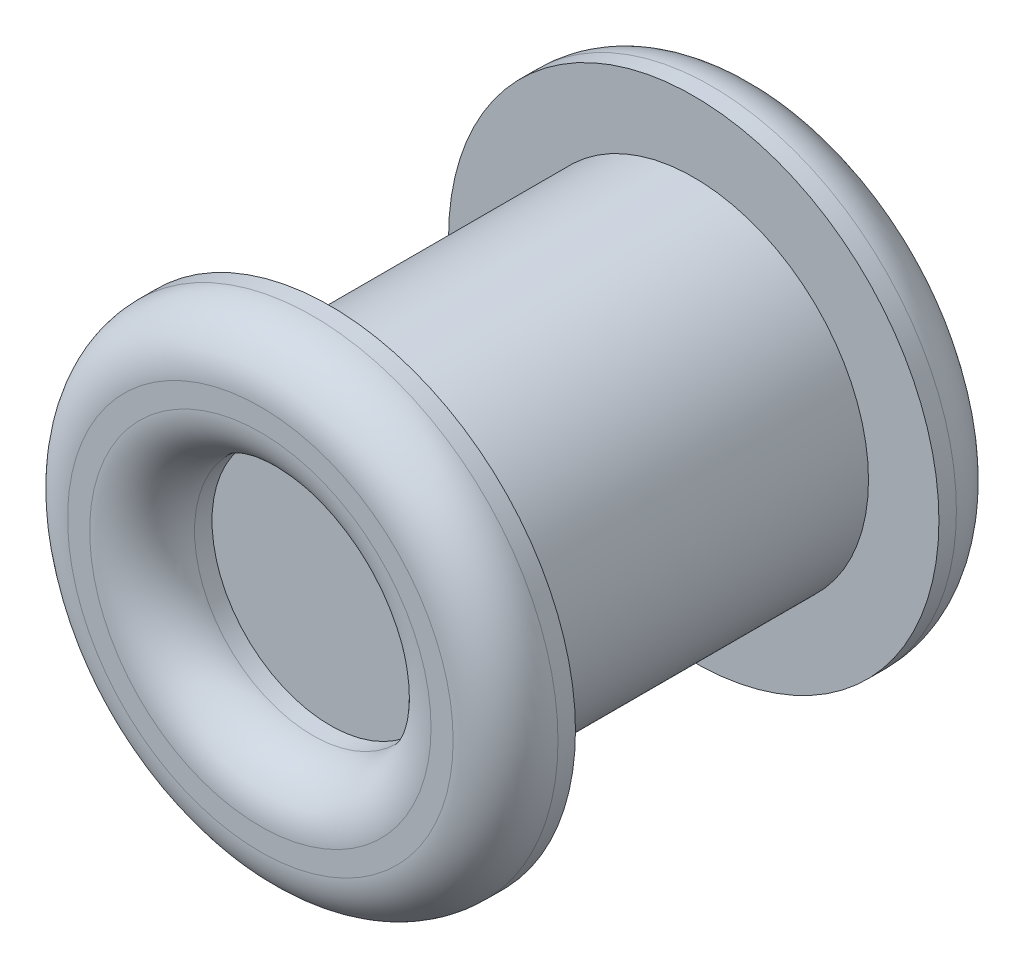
from build123d import *

# Parameters (mm, degrees)
BOSS_EXTRU_1_DEPTH      = 2.6
BOSS_EXTRU_1_DEPTH_BACK = 2.6
ESQUISSE1_R             = 2.5
ESQUISSE2_R             = 3.507896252
ESQUISSE2_R_2           = 1.691773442
BOSS_EXTRU_2_DEPTH      = 1
CONG_1_R                = 0.75


with BuildPart() as part:
    # Esquisse1 → Boss.-Extru.1 (new, two sides: drawn at the far end of the back side and taken through both)
    with BuildSketch(Plane.XY.offset(-BOSS_EXTRU_1_DEPTH_BACK)):
        with Locations((0, -54)):
            Circle(ESQUISSE1_R)
    extrude(amount=BOSS_EXTRU_1_DEPTH + BOSS_EXTRU_1_DEPTH_BACK)

    # Esquisse2 → Boss.-Extru.2 (add)
    with BuildSketch(Plane.XY.offset(2.6)):
        with Locations((0, -54)):
            Circle(ESQUISSE2_R)
        with Locations((0, -54)):
            Circle(ESQUISSE2_R_2, mode=Mode.SUBTRACT)
    boss_extru_2 = extrude(amount=BOSS_EXTRU_2_DEPTH)

    # Sym_trie1: Boss.-Extru.2 across plane
    add(boss_extru_2.mirror(Plane.XY))

    # Cong_1
    cong_1_edges = [part.edges().sort_by_distance(p)[0] for p in [
        (-3.507896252, -54, -3.6),
        (-1.691773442, -54, -3.6),
        (-3.507896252, -54, 3.6),
        (-1.691773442, -54, 3.6),
    ]]
    fillet(cong_1_edges, radius=CONG_1_R)


solid = part.part
